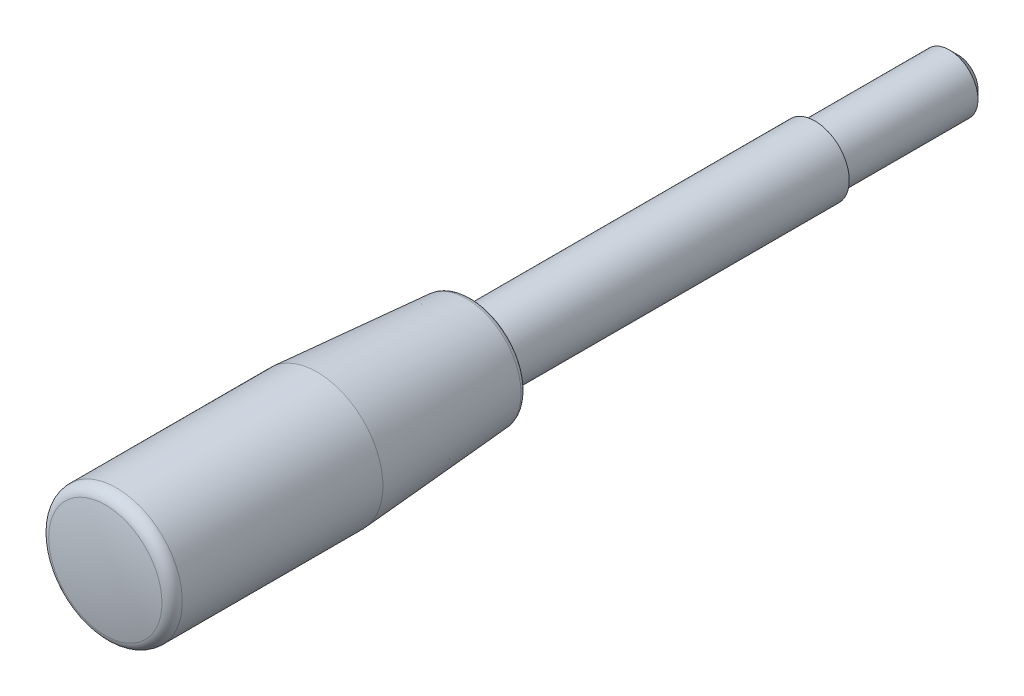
ISO-10303-21;
HEADER;
FILE_DESCRIPTION(('STEP AP214'),'2;1');
FILE_NAME('part.step','',(''),(''),'','','');
FILE_SCHEMA(('AUTOMOTIVE_DESIGN { 1 0 10303 214 1 1 1 1 }'));
ENDSEC;
DATA;
#1=APPLICATION_CONTEXT('core data for automotive mechanical design processes');
#2=APPLICATION_PROTOCOL_DEFINITION('international standard','automotive_design',2000,#1);
#3=PRODUCT_CONTEXT('',#1,'mechanical');
#4=PRODUCT('Part','Part','',(#3));
#5=PRODUCT_RELATED_PRODUCT_CATEGORY('part','',(#4));
#6=PRODUCT_DEFINITION_FORMATION('','',#4);
#7=PRODUCT_DEFINITION_CONTEXT('part definition',#1,'design');
#8=PRODUCT_DEFINITION('design','',#6,#7);
#9=PRODUCT_DEFINITION_SHAPE('','',#8);
#10=(LENGTH_UNIT() NAMED_UNIT(*) SI_UNIT(.MILLI.,.METRE.));
#11=(NAMED_UNIT(*) PLANE_ANGLE_UNIT() SI_UNIT($,.RADIAN.));
#12=(NAMED_UNIT(*) SI_UNIT($,.STERADIAN.) SOLID_ANGLE_UNIT());
#13=UNCERTAINTY_MEASURE_WITH_UNIT(LENGTH_MEASURE(1.E-05),#10,'distance_accuracy_value','');
#14=(GEOMETRIC_REPRESENTATION_CONTEXT(3) GLOBAL_UNCERTAINTY_ASSIGNED_CONTEXT((#13)) GLOBAL_UNIT_ASSIGNED_CONTEXT((#10,
#11,#12)) REPRESENTATION_CONTEXT('',''));
#15=CARTESIAN_POINT('',(0.,0.,0.));
#16=DIRECTION('',(0.,0.,1.));
#17=DIRECTION('',(1.,0.,0.));
#18=AXIS2_PLACEMENT_3D('',#15,#16,#17);
#19=CARTESIAN_POINT('',(0.,6.,0.));
#20=DIRECTION('',(0.,0.,1.));
#21=DIRECTION('',(1.,0.,0.));
#22=AXIS2_PLACEMENT_3D('',#19,#20,#21);
#23=PLANE('',#22);
#24=CARTESIAN_POINT('',(0.,0.,0.));
#25=DIRECTION('',(0.,0.,-1.));
#26=DIRECTION('',(-1.,0.,0.));
#27=AXIS2_PLACEMENT_3D('',#24,#25,#26);
#28=CIRCLE('',#27,5.);
#29=CARTESIAN_POINT('',(-5.,0.,0.));
#30=VERTEX_POINT('',#29);
#31=EDGE_CURVE('E8',#30,#30,#28,.T.);
#32=ORIENTED_EDGE('',*,*,#31,.F.);
#33=EDGE_LOOP('',(#32));
#34=FACE_BOUND('',#33,.T.);
#35=CARTESIAN_POINT('',(0.,0.,0.));
#36=DIRECTION('',(0.,0.,-1.));
#37=DIRECTION('',(-1.,0.,0.));
#38=AXIS2_PLACEMENT_3D('',#35,#36,#37);
#39=CIRCLE('',#38,6.);
#40=CARTESIAN_POINT('',(-6.,0.,0.));
#41=VERTEX_POINT('',#40);
#42=EDGE_CURVE('E46',#41,#41,#39,.T.);
#43=ORIENTED_EDGE('',*,*,#42,.T.);
#44=EDGE_LOOP('',(#43));
#45=FACE_BOUND('',#44,.T.);
#46=ADVANCED_FACE('F12',(#34,#45),#23,.F.);
#47=CARTESIAN_POINT('',(0.,0.,-36.3590628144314));
#48=DIRECTION('',(0.,0.,-1.));
#49=DIRECTION('',(-1.,0.,0.));
#50=AXIS2_PLACEMENT_3D('',#47,#48,#49);
#51=CYLINDRICAL_SURFACE('',#50,5.);
#52=ORIENTED_EDGE('',*,*,#31,.T.);
#53=EDGE_LOOP('',(#52));
#54=FACE_BOUND('',#53,.T.);
#55=CARTESIAN_POINT('',(0.,0.,-23.5));
#56=DIRECTION('',(0.,0.,-1.));
#57=DIRECTION('',(-1.,0.,0.));
#58=AXIS2_PLACEMENT_3D('',#55,#56,#57);
#59=CIRCLE('',#58,5.);
#60=CARTESIAN_POINT('',(-5.,0.,-23.5));
#61=VERTEX_POINT('',#60);
#62=EDGE_CURVE('E18',#61,#61,#59,.T.);
#63=ORIENTED_EDGE('',*,*,#62,.F.);
#64=EDGE_LOOP('',(#63));
#65=FACE_BOUND('',#64,.T.);
#66=ADVANCED_FACE('F100',(#54,#65),#51,.T.);
#67=CARTESIAN_POINT('',(0.,0.,-23.5));
#68=DIRECTION('',(0.,0.,1.));
#69=DIRECTION('',(1.,0.,0.));
#70=AXIS2_PLACEMENT_3D('',#67,#68,#69);
#71=CONICAL_SURFACE('',#70,5.,0.785398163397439);
#72=CARTESIAN_POINT('',(0.,0.,-25.));
#73=DIRECTION('',(0.,0.,-1.));
#74=DIRECTION('',(-1.,0.,0.));
#75=AXIS2_PLACEMENT_3D('',#72,#73,#74);
#76=CIRCLE('',#75,3.5);
#77=CARTESIAN_POINT('',(-3.5,0.,-25.));
#78=VERTEX_POINT('',#77);
#79=EDGE_CURVE('E22',#78,#78,#76,.T.);
#80=ORIENTED_EDGE('',*,*,#79,.F.);
#81=EDGE_LOOP('',(#80));
#82=FACE_BOUND('',#81,.T.);
#83=ORIENTED_EDGE('',*,*,#62,.T.);
#84=EDGE_LOOP('',(#83));
#85=FACE_BOUND('',#84,.T.);
#86=ADVANCED_FACE('F96',(#82,#85),#71,.T.);
#87=CARTESIAN_POINT('',(0.,3.5,-25.));
#88=DIRECTION('',(0.,0.,1.));
#89=DIRECTION('',(1.,0.,0.));
#90=AXIS2_PLACEMENT_3D('',#87,#88,#89);
#91=PLANE('',#90);
#92=ORIENTED_EDGE('',*,*,#79,.T.);
#93=EDGE_LOOP('',(#92));
#94=FACE_BOUND('',#93,.T.);
#95=ADVANCED_FACE('F89',(#94),#91,.F.);
#96=CARTESIAN_POINT('',(0.,0.,75.));
#97=DIRECTION('',(-1.,0.,0.));
#98=DIRECTION('',(0.,0.,1.));
#99=AXIS2_PLACEMENT_3D('',#96,#97,#98);
#100=SPHERICAL_SURFACE('',#99,50.);
#101=CARTESIAN_POINT('',(0.,0.,75.));
#102=DIRECTION('',(0.,0.,-1.));
#103=DIRECTION('',(-1.,0.,0.));
#104=AXIS2_PLACEMENT_3D('',#101,#102,#103);
#105=SPHERICAL_SURFACE('',#104,50.);
#106=CARTESIAN_POINT('',(0.,0.,124.010942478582));
#107=DIRECTION('',(0.,0.,-1.));
#108=DIRECTION('',(-1.,0.,0.));
#109=AXIS2_PLACEMENT_3D('',#106,#107,#108);
#110=CIRCLE('',#109,9.8958333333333);
#111=CARTESIAN_POINT('',(-9.8958333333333,0.,124.010942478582));
#112=VERTEX_POINT('',#111);
#113=EDGE_CURVE('E26',#112,#112,#110,.T.);
#114=ORIENTED_EDGE('',*,*,#113,.F.);
#115=EDGE_LOOP('',(#114));
#116=FACE_BOUND('',#115,.T.);
#117=ADVANCED_FACE('F84',(#116),#105,.T.);
#118=CARTESIAN_POINT('',(0.,0.,122.050504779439));
#119=DIRECTION('',(0.,0.,-1.));
#120=DIRECTION('',(-1.,0.,0.));
#121=AXIS2_PLACEMENT_3D('',#118,#119,#120);
#122=TOROIDAL_SURFACE('',#121,9.5,2.);
#123=CARTESIAN_POINT('',(0.,0.,122.050504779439));
#124=DIRECTION('',(0.,0.,-1.));
#125=DIRECTION('',(-1.,0.,0.));
#126=AXIS2_PLACEMENT_3D('',#123,#124,#125);
#127=CIRCLE('',#126,11.5);
#128=CARTESIAN_POINT('',(-11.5,0.,122.050504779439));
#129=VERTEX_POINT('',#128);
#130=EDGE_CURVE('E31',#129,#129,#127,.T.);
#131=ORIENTED_EDGE('',*,*,#130,.F.);
#132=EDGE_LOOP('',(#131));
#133=FACE_BOUND('',#132,.T.);
#134=ORIENTED_EDGE('',*,*,#113,.T.);
#135=EDGE_LOOP('',(#134));
#136=FACE_BOUND('',#135,.T.);
#137=ADVANCED_FACE('F78',(#133,#136),#122,.T.);
#138=CARTESIAN_POINT('',(0.,0.,-36.3590628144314));
#139=DIRECTION('',(0.,0.,-1.));
#140=DIRECTION('',(-1.,0.,0.));
#141=AXIS2_PLACEMENT_3D('',#138,#139,#140);
#142=CYLINDRICAL_SURFACE('',#141,11.5);
#143=CARTESIAN_POINT('',(0.,0.,87.));
#144=DIRECTION('',(0.,0.,-1.));
#145=DIRECTION('',(-1.,0.,0.));
#146=AXIS2_PLACEMENT_3D('',#143,#144,#145);
#147=CIRCLE('',#146,11.5);
#148=CARTESIAN_POINT('',(-11.5,0.,87.));
#149=VERTEX_POINT('',#148);
#150=EDGE_CURVE('E34',#149,#149,#147,.T.);
#151=ORIENTED_EDGE('',*,*,#150,.F.);
#152=EDGE_LOOP('',(#151));
#153=FACE_BOUND('',#152,.T.);
#154=ORIENTED_EDGE('',*,*,#130,.T.);
#155=EDGE_LOOP('',(#154));
#156=FACE_BOUND('',#155,.T.);
#157=ADVANCED_FACE('F72',(#153,#156),#142,.T.);
#158=CARTESIAN_POINT('',(0.,0.,87.));
#159=DIRECTION('',(0.,0.,1.));
#160=DIRECTION('',(1.,0.,0.));
#161=AXIS2_PLACEMENT_3D('',#158,#159,#160);
#162=CONICAL_SURFACE('',#161,11.5,0.0739390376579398);
#163=CARTESIAN_POINT('',(0.,0.,60.9261283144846));
#164=DIRECTION('',(0.,0.,-1.));
#165=DIRECTION('',(-1.,0.,0.));
#166=AXIS2_PLACEMENT_3D('',#163,#164,#165);
#167=CIRCLE('',#166,9.56860209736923);
#168=CARTESIAN_POINT('',(-9.56860209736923,0.,60.9261283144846));
#169=VERTEX_POINT('',#168);
#170=EDGE_CURVE('E37',#169,#169,#167,.T.);
#171=ORIENTED_EDGE('',*,*,#170,.F.);
#172=EDGE_LOOP('',(#171));
#173=FACE_BOUND('',#172,.T.);
#174=ORIENTED_EDGE('',*,*,#150,.T.);
#175=EDGE_LOOP('',(#174));
#176=FACE_BOUND('',#175,.T.);
#177=ADVANCED_FACE('F66',(#173,#176),#162,.T.);
#178=CARTESIAN_POINT('',(0.,0.,61.));
#179=DIRECTION('',(0.,0.,-1.));
#180=DIRECTION('',(-1.,0.,0.));
#181=AXIS2_PLACEMENT_3D('',#178,#179,#180);
#182=TOROIDAL_SURFACE('',#181,8.57133434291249,1.00000000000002);
#183=CARTESIAN_POINT('',(0.,0.,60.));
#184=DIRECTION('',(0.,0.,-1.));
#185=DIRECTION('',(-1.,0.,0.));
#186=AXIS2_PLACEMENT_3D('',#183,#184,#185);
#187=CIRCLE('',#186,8.57133434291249);
#188=CARTESIAN_POINT('',(-8.57133434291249,0.,60.));
#189=VERTEX_POINT('',#188);
#190=EDGE_CURVE('E40',#189,#189,#187,.T.);
#191=ORIENTED_EDGE('',*,*,#190,.F.);
#192=EDGE_LOOP('',(#191));
#193=FACE_BOUND('',#192,.T.);
#194=ORIENTED_EDGE('',*,*,#170,.T.);
#195=EDGE_LOOP('',(#194));
#196=FACE_BOUND('',#195,.T.);
#197=ADVANCED_FACE('F60',(#193,#196),#182,.T.);
#198=CARTESIAN_POINT('',(0.,8.57133434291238,60.));
#199=DIRECTION('',(0.,0.,1.));
#200=DIRECTION('',(1.,0.,0.));
#201=AXIS2_PLACEMENT_3D('',#198,#199,#200);
#202=PLANE('',#201);
#203=CARTESIAN_POINT('',(0.,0.,60.));
#204=DIRECTION('',(0.,0.,-1.));
#205=DIRECTION('',(-1.,0.,0.));
#206=AXIS2_PLACEMENT_3D('',#203,#204,#205);
#207=CIRCLE('',#206,6.);
#208=CARTESIAN_POINT('',(-6.,0.,60.));
#209=VERTEX_POINT('',#208);
#210=EDGE_CURVE('E43',#209,#209,#207,.T.);
#211=ORIENTED_EDGE('',*,*,#210,.F.);
#212=EDGE_LOOP('',(#211));
#213=FACE_BOUND('',#212,.T.);
#214=ORIENTED_EDGE('',*,*,#190,.T.);
#215=EDGE_LOOP('',(#214));
#216=FACE_BOUND('',#215,.T.);
#217=ADVANCED_FACE('F54',(#213,#216),#202,.F.);
#218=CARTESIAN_POINT('',(0.,0.,-36.3590628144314));
#219=DIRECTION('',(0.,0.,-1.));
#220=DIRECTION('',(-1.,0.,0.));
#221=AXIS2_PLACEMENT_3D('',#218,#219,#220);
#222=CYLINDRICAL_SURFACE('',#221,6.);
#223=ORIENTED_EDGE('',*,*,#42,.F.);
#224=EDGE_LOOP('',(#223));
#225=FACE_BOUND('',#224,.T.);
#226=ORIENTED_EDGE('',*,*,#210,.T.);
#227=EDGE_LOOP('',(#226));
#228=FACE_BOUND('',#227,.T.);
#229=ADVANCED_FACE('F51',(#225,#228),#222,.T.);
#230=CLOSED_SHELL('',(#46,#66,#86,#95,#117,#137,#157,#177,#197,#217,#229));
#231=MANIFOLD_SOLID_BREP('B1',#230);
#232=ADVANCED_BREP_SHAPE_REPRESENTATION('',(#18,#231),#14);
#233=SHAPE_DEFINITION_REPRESENTATION(#9,#232);
ENDSEC;
END-ISO-10303-21;
